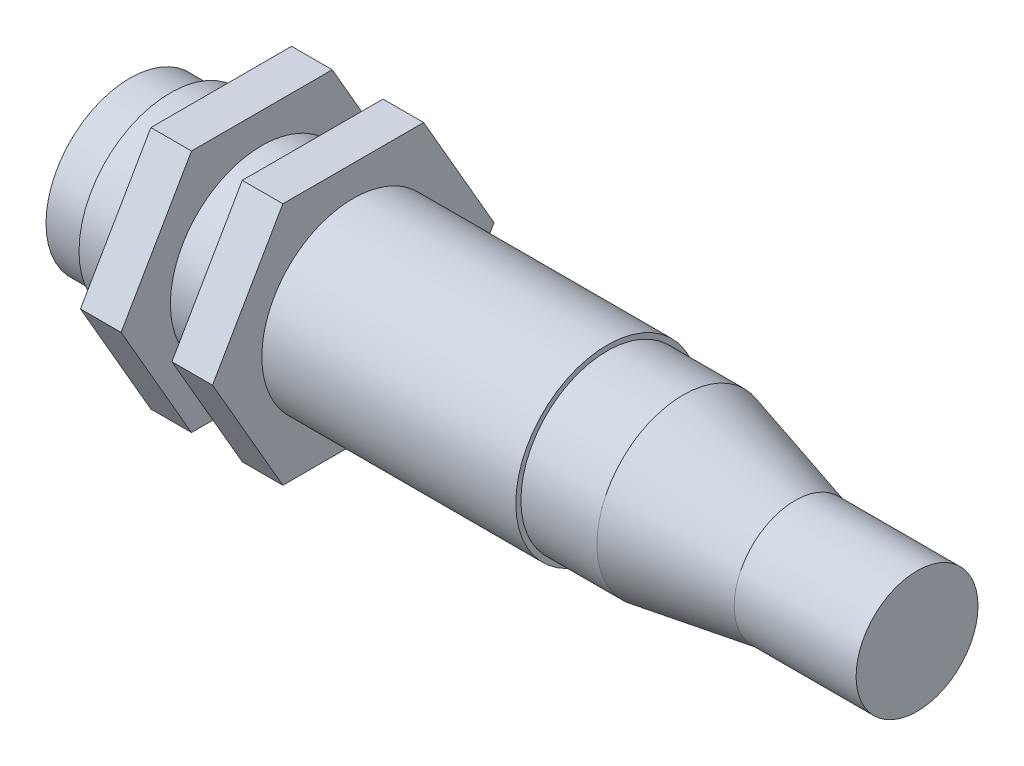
ISO-10303-21;
HEADER;
FILE_DESCRIPTION(('STEP AP214'),'2;1');
FILE_NAME('part.step','',(''),(''),'','','');
FILE_SCHEMA(('AUTOMOTIVE_DESIGN { 1 0 10303 214 1 1 1 1 }'));
ENDSEC;
DATA;
#1=APPLICATION_CONTEXT('core data for automotive mechanical design processes');
#2=APPLICATION_PROTOCOL_DEFINITION('international standard','automotive_design',2000,#1);
#3=PRODUCT_CONTEXT('',#1,'mechanical');
#4=PRODUCT('Part','Part','',(#3));
#5=PRODUCT_RELATED_PRODUCT_CATEGORY('part','',(#4));
#6=PRODUCT_DEFINITION_FORMATION('','',#4);
#7=PRODUCT_DEFINITION_CONTEXT('part definition',#1,'design');
#8=PRODUCT_DEFINITION('design','',#6,#7);
#9=PRODUCT_DEFINITION_SHAPE('','',#8);
#10=(LENGTH_UNIT() NAMED_UNIT(*) SI_UNIT(.MILLI.,.METRE.));
#11=(NAMED_UNIT(*) PLANE_ANGLE_UNIT() SI_UNIT($,.RADIAN.));
#12=(NAMED_UNIT(*) SI_UNIT($,.STERADIAN.) SOLID_ANGLE_UNIT());
#13=UNCERTAINTY_MEASURE_WITH_UNIT(LENGTH_MEASURE(1.E-05),#10,'distance_accuracy_value','');
#14=(GEOMETRIC_REPRESENTATION_CONTEXT(3) GLOBAL_UNCERTAINTY_ASSIGNED_CONTEXT((#13)) GLOBAL_UNIT_ASSIGNED_CONTEXT((#10,
#11,#12)) REPRESENTATION_CONTEXT('',''));
#15=CARTESIAN_POINT('',(0.,0.,0.));
#16=DIRECTION('',(0.,0.,1.));
#17=DIRECTION('',(1.,0.,0.));
#18=AXIS2_PLACEMENT_3D('',#15,#16,#17);
#19=CARTESIAN_POINT('',(9.,24.,0.));
#20=DIRECTION('',(1.,0.,0.));
#21=DIRECTION('',(0.,0.,-1.));
#22=AXIS2_PLACEMENT_3D('',#19,#20,#21);
#23=PLANE('',#22);
#24=DIRECTION('',(0.,0.866025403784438,0.5));
#25=VECTOR('',#24,1.);
#26=CARTESIAN_POINT('',(9.,0.,-13.856406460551));
#27=LINE('',#26,#25);
#28=CARTESIAN_POINT('',(9.,0.,-13.856406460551));
#29=VERTEX_POINT('',#28);
#30=CARTESIAN_POINT('',(9.,12.,-6.9282032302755));
#31=VERTEX_POINT('',#30);
#32=EDGE_CURVE('E133',#29,#31,#27,.T.);
#33=ORIENTED_EDGE('',*,*,#32,.T.);
#34=DIRECTION('',(0.,0.,1.));
#35=VECTOR('',#34,1.);
#36=CARTESIAN_POINT('',(9.,12.,-6.9282032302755));
#37=LINE('',#36,#35);
#38=CARTESIAN_POINT('',(9.,12.,6.92820323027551));
#39=VERTEX_POINT('',#38);
#40=EDGE_CURVE('E114',#31,#39,#37,.T.);
#41=ORIENTED_EDGE('',*,*,#40,.T.);
#42=DIRECTION('',(0.,-0.866025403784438,0.5));
#43=VECTOR('',#42,1.);
#44=CARTESIAN_POINT('',(9.,12.,6.92820323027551));
#45=LINE('',#44,#43);
#46=CARTESIAN_POINT('',(9.,0.,13.856406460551));
#47=VERTEX_POINT('',#46);
#48=EDGE_CURVE('E136',#39,#47,#45,.T.);
#49=ORIENTED_EDGE('',*,*,#48,.T.);
#50=DIRECTION('',(0.,-0.866025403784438,-0.5));
#51=VECTOR('',#50,1.);
#52=CARTESIAN_POINT('',(9.,0.,13.856406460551));
#53=LINE('',#52,#51);
#54=CARTESIAN_POINT('',(9.,-12.,6.9282032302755));
#55=VERTEX_POINT('',#54);
#56=EDGE_CURVE('E138',#47,#55,#53,.T.);
#57=ORIENTED_EDGE('',*,*,#56,.T.);
#58=DIRECTION('',(0.,0.,-1.));
#59=VECTOR('',#58,1.);
#60=CARTESIAN_POINT('',(9.,-12.,6.9282032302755));
#61=LINE('',#60,#59);
#62=CARTESIAN_POINT('',(9.,-12.,-6.92820323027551));
#63=VERTEX_POINT('',#62);
#64=EDGE_CURVE('E67',#55,#63,#61,.T.);
#65=ORIENTED_EDGE('',*,*,#64,.T.);
#66=DIRECTION('',(0.,0.866025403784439,-0.5));
#67=VECTOR('',#66,1.);
#68=CARTESIAN_POINT('',(9.,-12.,-6.92820323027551));
#69=LINE('',#68,#67);
#70=EDGE_CURVE('E62',#63,#29,#69,.T.);
#71=ORIENTED_EDGE('',*,*,#70,.T.);
#72=EDGE_LOOP('',(#33,#41,#49,#57,#65,#71));
#73=FACE_BOUND('',#72,.T.);
#74=CARTESIAN_POINT('',(9.,0.,0.));
#75=DIRECTION('',(1.,0.,0.));
#76=DIRECTION('',(0.,0.,-1.));
#77=AXIS2_PLACEMENT_3D('',#74,#75,#76);
#78=CIRCLE('',#77,9.);
#79=CARTESIAN_POINT('',(9.,0.,-9.));
#80=VERTEX_POINT('',#79);
#81=EDGE_CURVE('E119',#80,#80,#78,.T.);
#82=ORIENTED_EDGE('',*,*,#81,.F.);
#83=EDGE_LOOP('',(#82));
#84=FACE_BOUND('',#83,.T.);
#85=ADVANCED_FACE('F47',(#73,#84),#23,.T.);
#86=CARTESIAN_POINT('',(5.,24.,0.));
#87=DIRECTION('',(1.,0.,0.));
#88=DIRECTION('',(0.,0.,-1.));
#89=AXIS2_PLACEMENT_3D('',#86,#87,#88);
#90=PLANE('',#89);
#91=DIRECTION('',(0.,0.866025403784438,0.5));
#92=VECTOR('',#91,1.);
#93=CARTESIAN_POINT('',(5.,0.,-13.856406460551));
#94=LINE('',#93,#92);
#95=CARTESIAN_POINT('',(5.,0.,-13.856406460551));
#96=VERTEX_POINT('',#95);
#97=CARTESIAN_POINT('',(5.,12.,-6.9282032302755));
#98=VERTEX_POINT('',#97);
#99=EDGE_CURVE('E105',#96,#98,#94,.T.);
#100=ORIENTED_EDGE('',*,*,#99,.F.);
#101=DIRECTION('',(0.,0.866025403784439,-0.5));
#102=VECTOR('',#101,1.);
#103=CARTESIAN_POINT('',(5.,-12.,-6.92820323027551));
#104=LINE('',#103,#102);
#105=CARTESIAN_POINT('',(5.,-12.,-6.92820323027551));
#106=VERTEX_POINT('',#105);
#107=EDGE_CURVE('E131',#106,#96,#104,.T.);
#108=ORIENTED_EDGE('',*,*,#107,.F.);
#109=DIRECTION('',(0.,0.,-1.));
#110=VECTOR('',#109,1.);
#111=CARTESIAN_POINT('',(5.,-12.,6.9282032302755));
#112=LINE('',#111,#110);
#113=CARTESIAN_POINT('',(5.,-12.,6.9282032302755));
#114=VERTEX_POINT('',#113);
#115=EDGE_CURVE('E129',#114,#106,#112,.T.);
#116=ORIENTED_EDGE('',*,*,#115,.F.);
#117=DIRECTION('',(0.,-0.866025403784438,-0.5));
#118=VECTOR('',#117,1.);
#119=CARTESIAN_POINT('',(5.,0.,13.856406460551));
#120=LINE('',#119,#118);
#121=CARTESIAN_POINT('',(5.,0.,13.856406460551));
#122=VERTEX_POINT('',#121);
#123=EDGE_CURVE('E127',#122,#114,#120,.T.);
#124=ORIENTED_EDGE('',*,*,#123,.F.);
#125=DIRECTION('',(0.,-0.866025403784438,0.5));
#126=VECTOR('',#125,1.);
#127=CARTESIAN_POINT('',(5.,12.,6.92820323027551));
#128=LINE('',#127,#126);
#129=CARTESIAN_POINT('',(5.,12.,6.92820323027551));
#130=VERTEX_POINT('',#129);
#131=EDGE_CURVE('E107',#130,#122,#128,.T.);
#132=ORIENTED_EDGE('',*,*,#131,.F.);
#133=DIRECTION('',(0.,0.,1.));
#134=VECTOR('',#133,1.);
#135=CARTESIAN_POINT('',(5.,12.,-6.9282032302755));
#136=LINE('',#135,#134);
#137=EDGE_CURVE('E100',#98,#130,#136,.T.);
#138=ORIENTED_EDGE('',*,*,#137,.F.);
#139=EDGE_LOOP('',(#100,#108,#116,#124,#132,#138));
#140=FACE_BOUND('',#139,.T.);
#141=CARTESIAN_POINT('',(5.,0.,0.));
#142=DIRECTION('',(1.,0.,0.));
#143=DIRECTION('',(0.,0.,-1.));
#144=AXIS2_PLACEMENT_3D('',#141,#142,#143);
#145=CIRCLE('',#144,9.);
#146=CARTESIAN_POINT('',(5.,0.,-9.));
#147=VERTEX_POINT('',#146);
#148=EDGE_CURVE('E122',#147,#147,#145,.T.);
#149=ORIENTED_EDGE('',*,*,#148,.T.);
#150=EDGE_LOOP('',(#149));
#151=FACE_BOUND('',#150,.T.);
#152=ADVANCED_FACE('F101',(#140,#151),#90,.F.);
#153=CARTESIAN_POINT('',(9.,0.,-13.856406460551));
#154=DIRECTION('',(0.,-0.5,0.866025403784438));
#155=DIRECTION('',(0.,-0.866025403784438,-0.5));
#156=AXIS2_PLACEMENT_3D('',#153,#154,#155);
#157=PLANE('',#156);
#158=ORIENTED_EDGE('',*,*,#99,.T.);
#159=DIRECTION('',(-1.,0.,0.));
#160=VECTOR('',#159,1.);
#161=CARTESIAN_POINT('',(9.,12.,-6.9282032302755));
#162=LINE('',#161,#160);
#163=EDGE_CURVE('E12',#31,#98,#162,.T.);
#164=ORIENTED_EDGE('',*,*,#163,.F.);
#165=ORIENTED_EDGE('',*,*,#32,.F.);
#166=DIRECTION('',(-1.,0.,0.));
#167=VECTOR('',#166,1.);
#168=CARTESIAN_POINT('',(9.,0.,-13.856406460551));
#169=LINE('',#168,#167);
#170=EDGE_CURVE('E118',#29,#96,#169,.T.);
#171=ORIENTED_EDGE('',*,*,#170,.T.);
#172=EDGE_LOOP('',(#158,#164,#165,#171));
#173=FACE_BOUND('',#172,.T.);
#174=ADVANCED_FACE('F49',(#173),#157,.F.);
#175=CARTESIAN_POINT('',(9.,12.,-6.9282032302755));
#176=DIRECTION('',(0.,-1.,0.));
#177=DIRECTION('',(0.,0.,-1.));
#178=AXIS2_PLACEMENT_3D('',#175,#176,#177);
#179=PLANE('',#178);
#180=ORIENTED_EDGE('',*,*,#137,.T.);
#181=DIRECTION('',(-1.,0.,0.));
#182=VECTOR('',#181,1.);
#183=CARTESIAN_POINT('',(9.,12.,6.92820323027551));
#184=LINE('',#183,#182);
#185=EDGE_CURVE('E55',#39,#130,#184,.T.);
#186=ORIENTED_EDGE('',*,*,#185,.F.);
#187=ORIENTED_EDGE('',*,*,#40,.F.);
#188=ORIENTED_EDGE('',*,*,#163,.T.);
#189=EDGE_LOOP('',(#180,#186,#187,#188));
#190=FACE_BOUND('',#189,.T.);
#191=ADVANCED_FACE('F113',(#190),#179,.F.);
#192=CARTESIAN_POINT('',(9.,12.,6.92820323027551));
#193=DIRECTION('',(0.,-0.5,-0.866025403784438));
#194=DIRECTION('',(0.,0.866025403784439,-0.5));
#195=AXIS2_PLACEMENT_3D('',#192,#193,#194);
#196=PLANE('',#195);
#197=ORIENTED_EDGE('',*,*,#131,.T.);
#198=DIRECTION('',(-1.,0.,0.));
#199=VECTOR('',#198,1.);
#200=CARTESIAN_POINT('',(9.,0.,13.856406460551));
#201=LINE('',#200,#199);
#202=EDGE_CURVE('E149',#47,#122,#201,.T.);
#203=ORIENTED_EDGE('',*,*,#202,.F.);
#204=ORIENTED_EDGE('',*,*,#48,.F.);
#205=ORIENTED_EDGE('',*,*,#185,.T.);
#206=EDGE_LOOP('',(#197,#203,#204,#205));
#207=FACE_BOUND('',#206,.T.);
#208=ADVANCED_FACE('F153',(#207),#196,.F.);
#209=CARTESIAN_POINT('',(9.,0.,13.856406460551));
#210=DIRECTION('',(0.,0.5,-0.866025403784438));
#211=DIRECTION('',(0.,0.866025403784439,0.5));
#212=AXIS2_PLACEMENT_3D('',#209,#210,#211);
#213=PLANE('',#212);
#214=ORIENTED_EDGE('',*,*,#123,.T.);
#215=DIRECTION('',(-1.,0.,0.));
#216=VECTOR('',#215,1.);
#217=CARTESIAN_POINT('',(9.,-12.,6.9282032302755));
#218=LINE('',#217,#216);
#219=EDGE_CURVE('E146',#55,#114,#218,.T.);
#220=ORIENTED_EDGE('',*,*,#219,.F.);
#221=ORIENTED_EDGE('',*,*,#56,.F.);
#222=ORIENTED_EDGE('',*,*,#202,.T.);
#223=EDGE_LOOP('',(#214,#220,#221,#222));
#224=FACE_BOUND('',#223,.T.);
#225=ADVANCED_FACE('F159',(#224),#213,.F.);
#226=CARTESIAN_POINT('',(9.,-12.,6.9282032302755));
#227=DIRECTION('',(0.,1.,0.));
#228=DIRECTION('',(0.,0.,1.));
#229=AXIS2_PLACEMENT_3D('',#226,#227,#228);
#230=PLANE('',#229);
#231=ORIENTED_EDGE('',*,*,#115,.T.);
#232=DIRECTION('',(-1.,0.,0.));
#233=VECTOR('',#232,1.);
#234=CARTESIAN_POINT('',(9.,-12.,-6.92820323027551));
#235=LINE('',#234,#233);
#236=EDGE_CURVE('E143',#63,#106,#235,.T.);
#237=ORIENTED_EDGE('',*,*,#236,.F.);
#238=ORIENTED_EDGE('',*,*,#64,.F.);
#239=ORIENTED_EDGE('',*,*,#219,.T.);
#240=EDGE_LOOP('',(#231,#237,#238,#239));
#241=FACE_BOUND('',#240,.T.);
#242=ADVANCED_FACE('F162',(#241),#230,.F.);
#243=CARTESIAN_POINT('',(9.,-12.,-6.92820323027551));
#244=DIRECTION('',(0.,0.5,0.866025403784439));
#245=DIRECTION('',(0.,-0.866025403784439,0.5));
#246=AXIS2_PLACEMENT_3D('',#243,#244,#245);
#247=PLANE('',#246);
#248=ORIENTED_EDGE('',*,*,#107,.T.);
#249=ORIENTED_EDGE('',*,*,#170,.F.);
#250=ORIENTED_EDGE('',*,*,#70,.F.);
#251=ORIENTED_EDGE('',*,*,#236,.T.);
#252=EDGE_LOOP('',(#248,#249,#250,#251));
#253=FACE_BOUND('',#252,.T.);
#254=ADVANCED_FACE('F164',(#253),#247,.F.);
#255=CARTESIAN_POINT('',(9.,0.,0.));
#256=DIRECTION('',(-1.,0.,0.));
#257=DIRECTION('',(0.,0.,1.));
#258=AXIS2_PLACEMENT_3D('',#255,#256,#257);
#259=CYLINDRICAL_SURFACE('',#258,9.);
#260=ORIENTED_EDGE('',*,*,#81,.T.);
#261=EDGE_LOOP('',(#260));
#262=FACE_BOUND('',#261,.T.);
#263=ORIENTED_EDGE('',*,*,#148,.F.);
#264=EDGE_LOOP('',(#263));
#265=FACE_BOUND('',#264,.T.);
#266=ADVANCED_FACE('F166',(#262,#265),#259,.F.);
#267=CLOSED_SHELL('',(#85,#152,#174,#191,#208,#225,#242,#254,#266));
#268=MANIFOLD_SOLID_BREP('B2',#267);
#269=CARTESIAN_POINT('',(43.,0.,0.));
#270=DIRECTION('',(-1.,0.,0.));
#271=DIRECTION('',(0.,0.,1.));
#272=AXIS2_PLACEMENT_3D('',#269,#270,#271);
#273=PLANE('',#272);
#274=CARTESIAN_POINT('',(43.,0.,0.));
#275=DIRECTION('',(-1.,0.,0.));
#276=DIRECTION('',(0.,0.,1.));
#277=AXIS2_PLACEMENT_3D('',#274,#275,#276);
#278=CIRCLE('',#277,9.);
#279=CARTESIAN_POINT('',(43.,0.,9.));
#280=VERTEX_POINT('',#279);
#281=EDGE_CURVE('E273',#280,#280,#278,.T.);
#282=ORIENTED_EDGE('',*,*,#281,.F.);
#283=EDGE_LOOP('',(#282));
#284=FACE_BOUND('',#283,.T.);
#285=CARTESIAN_POINT('',(43.,0.,0.));
#286=DIRECTION('',(-1.,0.,0.));
#287=DIRECTION('',(0.,0.,1.));
#288=AXIS2_PLACEMENT_3D('',#285,#286,#287);
#289=CIRCLE('',#288,8.5);
#290=CARTESIAN_POINT('',(43.,0.,8.5));
#291=VERTEX_POINT('',#290);
#292=EDGE_CURVE('E46',#291,#291,#289,.F.);
#293=ORIENTED_EDGE('',*,*,#292,.F.);
#294=EDGE_LOOP('',(#293));
#295=FACE_BOUND('',#294,.T.);
#296=ADVANCED_FACE('F252',(#284,#295),#273,.F.);
#297=CARTESIAN_POINT('',(0.,0.,0.));
#298=DIRECTION('',(1.,0.,0.));
#299=DIRECTION('',(0.,0.,-1.));
#300=AXIS2_PLACEMENT_3D('',#297,#298,#299);
#301=PLANE('',#300);
#302=CARTESIAN_POINT('',(0.,0.,0.));
#303=DIRECTION('',(-1.,0.,0.));
#304=DIRECTION('',(0.,0.,1.));
#305=AXIS2_PLACEMENT_3D('',#302,#303,#304);
#306=CIRCLE('',#305,9.);
#307=CARTESIAN_POINT('',(0.,0.,9.));
#308=VERTEX_POINT('',#307);
#309=EDGE_CURVE('E268',#308,#308,#306,.T.);
#310=ORIENTED_EDGE('',*,*,#309,.T.);
#311=EDGE_LOOP('',(#310));
#312=FACE_BOUND('',#311,.T.);
#313=CARTESIAN_POINT('',(0.,0.,0.));
#314=DIRECTION('',(1.,0.,0.));
#315=DIRECTION('',(0.,0.,-1.));
#316=AXIS2_PLACEMENT_3D('',#313,#314,#315);
#317=CIRCLE('',#316,8.25);
#318=CARTESIAN_POINT('',(0.,0.,-8.25));
#319=VERTEX_POINT('',#318);
#320=EDGE_CURVE('E264',#319,#319,#317,.F.);
#321=ORIENTED_EDGE('',*,*,#320,.F.);
#322=EDGE_LOOP('',(#321));
#323=FACE_BOUND('',#322,.T.);
#324=ADVANCED_FACE('F254',(#312,#323),#301,.F.);
#325=CARTESIAN_POINT('',(0.,0.,0.));
#326=DIRECTION('',(-1.,0.,0.));
#327=DIRECTION('',(0.,0.,1.));
#328=AXIS2_PLACEMENT_3D('',#325,#326,#327);
#329=CYLINDRICAL_SURFACE('',#328,9.);
#330=ORIENTED_EDGE('',*,*,#309,.F.);
#331=EDGE_LOOP('',(#330));
#332=FACE_BOUND('',#331,.T.);
#333=ORIENTED_EDGE('',*,*,#281,.T.);
#334=EDGE_LOOP('',(#333));
#335=FACE_BOUND('',#334,.T.);
#336=ADVANCED_FACE('F323',(#332,#335),#329,.T.);
#337=CARTESIAN_POINT('',(-4.,0.,0.));
#338=DIRECTION('',(1.,0.,0.));
#339=DIRECTION('',(0.,0.,-1.));
#340=AXIS2_PLACEMENT_3D('',#337,#338,#339);
#341=CYLINDRICAL_SURFACE('',#340,8.25);
#342=CARTESIAN_POINT('',(-4.,0.,0.));
#343=DIRECTION('',(-1.,0.,0.));
#344=DIRECTION('',(0.,0.,1.));
#345=AXIS2_PLACEMENT_3D('',#342,#343,#344);
#346=CIRCLE('',#345,8.25);
#347=CARTESIAN_POINT('',(-4.,0.,8.25));
#348=VERTEX_POINT('',#347);
#349=EDGE_CURVE('E276',#348,#348,#346,.T.);
#350=ORIENTED_EDGE('',*,*,#349,.F.);
#351=EDGE_LOOP('',(#350));
#352=FACE_BOUND('',#351,.T.);
#353=ORIENTED_EDGE('',*,*,#320,.T.);
#354=EDGE_LOOP('',(#353));
#355=FACE_BOUND('',#354,.T.);
#356=ADVANCED_FACE('F319',(#352,#355),#341,.T.);
#357=CARTESIAN_POINT('',(-4.,0.,0.));
#358=DIRECTION('',(-1.,0.,0.));
#359=DIRECTION('',(0.,0.,1.));
#360=AXIS2_PLACEMENT_3D('',#357,#358,#359);
#361=PLANE('',#360);
#362=ORIENTED_EDGE('',*,*,#349,.T.);
#363=EDGE_LOOP('',(#362));
#364=FACE_BOUND('',#363,.T.);
#365=ADVANCED_FACE('F315',(#364),#361,.T.);
#366=CARTESIAN_POINT('',(50.5,0.,0.));
#367=DIRECTION('',(-1.,0.,0.));
#368=DIRECTION('',(0.,0.,1.));
#369=AXIS2_PLACEMENT_3D('',#366,#367,#368);
#370=CYLINDRICAL_SURFACE('',#369,8.5);
#371=CARTESIAN_POINT('',(50.4886719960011,-8.45758827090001,0.848056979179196));
#372=CARTESIAN_POINT('',(50.4878609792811,-8.44171022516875,1.00640847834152));
#373=CARTESIAN_POINT('',(50.4869423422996,-8.42138395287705,1.16431095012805));
#374=CARTESIAN_POINT('',(50.4854039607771,-8.37189222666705,1.47876966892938));
#375=CARTESIAN_POINT('',(50.4847842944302,-8.34272446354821,1.63532555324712));
#376=CARTESIAN_POINT('',(50.4841293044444,-8.27564108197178,1.94656313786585));
#377=CARTESIAN_POINT('',(50.4840940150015,-8.23772495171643,2.10124472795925));
#378=CARTESIAN_POINT('',(50.484662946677,-8.15322068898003,2.40840060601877));
#379=CARTESIAN_POINT('',(50.4852678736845,-8.1066230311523,2.56087226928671));
#380=CARTESIAN_POINT('',(50.486948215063,-8.00492950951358,2.86295246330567));
#381=CARTESIAN_POINT('',(50.488023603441,-7.94983411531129,3.01256115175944));
#382=CARTESIAN_POINT('',(50.4897005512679,-7.86095814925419,3.23445334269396));
#383=CARTESIAN_POINT('',(50.490270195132,-7.83029305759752,3.30799931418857));
#384=CARTESIAN_POINT('',(50.491365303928,-7.76690542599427,3.45420442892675));
#385=CARTESIAN_POINT('',(50.4918907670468,-7.73418280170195,3.52686353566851));
#386=CARTESIAN_POINT('',(50.4930509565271,-7.64986346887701,3.70727094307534));
#387=CARTESIAN_POINT('',(50.4936092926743,-7.59699894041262,3.81443009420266));
#388=CARTESIAN_POINT('',(50.4942065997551,-7.48679741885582,4.02643002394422));
#389=CARTESIAN_POINT('',(50.4942455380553,-7.429460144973,4.13127065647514));
#390=CARTESIAN_POINT('',(50.4940928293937,-7.31041594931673,4.3384431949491));
#391=CARTESIAN_POINT('',(50.4939011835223,-7.24870904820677,4.4407751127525));
#392=CARTESIAN_POINT('',(50.4934672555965,-7.12104305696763,4.64273876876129));
#393=CARTESIAN_POINT('',(50.493224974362,-7.05508403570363,4.74237055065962));
#394=CARTESIAN_POINT('',(50.4926292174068,-6.85102882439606,5.03690566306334));
#395=CARTESIAN_POINT('',(50.4924064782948,-6.7066984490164,5.22754625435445));
#396=CARTESIAN_POINT('',(50.4925233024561,-6.40251723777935,5.59596815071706));
#397=CARTESIAN_POINT('',(50.4928628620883,-6.24266650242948,5.77374953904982));
#398=CARTESIAN_POINT('',(50.4933178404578,-5.90853944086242,6.11524512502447));
#399=CARTESIAN_POINT('',(50.4934332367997,-5.73426167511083,6.27895791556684));
#400=CARTESIAN_POINT('',(50.4920137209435,-5.37254109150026,6.59112103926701));
#401=CARTESIAN_POINT('',(50.4904788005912,-5.18509820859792,6.73957129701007));
#402=CARTESIAN_POINT('',(50.4876735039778,-4.79837310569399,7.02016345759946));
#403=CARTESIAN_POINT('',(50.4864031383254,-4.59909041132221,7.15230470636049));
#404=CARTESIAN_POINT('',(50.4849673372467,-4.19008195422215,7.39934293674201));
#405=CARTESIAN_POINT('',(50.4848018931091,-3.98035627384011,7.51424005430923));
#406=CARTESIAN_POINT('',(50.4853798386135,-3.62341318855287,7.69066079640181));
#407=CARTESIAN_POINT('',(50.4858387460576,-3.47865483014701,7.75721155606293));
#408=CARTESIAN_POINT('',(50.4869868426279,-3.18562156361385,7.88207935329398));
#409=CARTESIAN_POINT('',(50.4876760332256,-3.03734663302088,7.94039633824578));
#410=CARTESIAN_POINT('',(50.4889468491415,-2.73774867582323,8.04860845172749));
#411=CARTESIAN_POINT('',(50.4895284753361,-2.58642567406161,8.09850364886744));
#412=CARTESIAN_POINT('',(50.489994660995,-2.35753402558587,8.16690744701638));
#413=CARTESIAN_POINT('',(50.4900823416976,-2.28091520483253,8.18863644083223));
#414=CARTESIAN_POINT('',(50.4900474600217,-2.12709733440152,8.22993309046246));
#415=CARTESIAN_POINT('',(50.4899248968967,-2.0498982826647,8.24950073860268));
#416=CARTESIAN_POINT('',(50.4893350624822,-1.81752295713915,8.3049363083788));
#417=CARTESIAN_POINT('',(50.4886456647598,-1.66155423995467,8.33754112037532));
#418=CARTESIAN_POINT('',(50.487190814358,-1.3480508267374,8.39393452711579));
#419=CARTESIAN_POINT('',(50.4864253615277,-1.19051612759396,8.41772310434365));
#420=CARTESIAN_POINT('',(50.4848399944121,-0.795276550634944,8.46608414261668));
#421=CARTESIAN_POINT('',(50.4841841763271,-0.556866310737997,8.48510257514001));
#422=CARTESIAN_POINT('',(50.4839313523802,-0.0793229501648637,8.50298923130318));
#423=CARTESIAN_POINT('',(50.4843343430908,0.159810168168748,8.50185752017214));
#424=CARTESIAN_POINT('',(50.4859308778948,0.637166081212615,8.47945069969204));
#425=CARTESIAN_POINT('',(50.487124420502,0.875388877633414,8.45817562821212));
#426=CARTESIAN_POINT('',(50.4888498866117,1.23067846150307,8.41128527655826));
#427=CARTESIAN_POINT('',(50.4894142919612,1.34878030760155,8.39315607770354));
#428=CARTESIAN_POINT('',(50.4903733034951,1.58412354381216,8.351934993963));
#429=CARTESIAN_POINT('',(50.4907679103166,1.70136493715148,8.32884312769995));
#430=CARTESIAN_POINT('',(50.4911735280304,1.93475094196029,8.27774175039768));
#431=CARTESIAN_POINT('',(50.4911845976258,2.0508957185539,8.24973299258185));
#432=CARTESIAN_POINT('',(50.4908201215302,2.28190142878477,8.18884568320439));
#433=CARTESIAN_POINT('',(50.4904445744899,2.39676235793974,8.15596711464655));
#434=CARTESIAN_POINT('',(50.4895485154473,2.62499862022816,8.08539725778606));
#435=CARTESIAN_POINT('',(50.4890280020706,2.7383739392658,8.04770592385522));
#436=CARTESIAN_POINT('',(50.4879796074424,2.96342789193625,7.96758226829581));
#437=CARTESIAN_POINT('',(50.4874517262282,3.07510653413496,7.92514997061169));
#438=CARTESIAN_POINT('',(50.4860384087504,3.40730171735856,7.79084874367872));
#439=CARTESIAN_POINT('',(50.4853229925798,3.62502771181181,7.69195995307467));
#440=CARTESIAN_POINT('',(50.4847549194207,4.05136555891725,7.47619703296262));
#441=CARTESIAN_POINT('',(50.4849022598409,4.25997743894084,7.35932295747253));
#442=CARTESIAN_POINT('',(50.4856814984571,4.59882571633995,7.15025765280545));
#443=CARTESIAN_POINT('',(50.4861355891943,4.73201681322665,7.06281724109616));
#444=CARTESIAN_POINT('',(50.4871284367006,4.99328155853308,6.88058878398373));
#445=CARTESIAN_POINT('',(50.4876671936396,5.12135519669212,6.7858007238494));
#446=CARTESIAN_POINT('',(50.4885533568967,5.37197862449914,6.58917386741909));
#447=CARTESIAN_POINT('',(50.4889007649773,5.49452846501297,6.48733513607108));
#448=CARTESIAN_POINT('',(50.4889958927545,5.6739045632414,6.32954590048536));
#449=CARTESIAN_POINT('',(50.4889565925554,5.73295786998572,6.27610828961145));
#450=CARTESIAN_POINT('',(50.4887033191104,5.84953952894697,6.1675950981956));
#451=CARTESIAN_POINT('',(50.488489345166,5.90706787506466,6.11251951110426));
#452=CARTESIAN_POINT('',(50.4876900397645,6.07729547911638,5.94490012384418));
#453=CARTESIAN_POINT('',(50.4869473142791,6.18764837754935,5.8299539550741));
#454=CARTESIAN_POINT('',(50.4854193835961,6.40170994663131,5.59405834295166));
#455=CARTESIAN_POINT('',(50.4846341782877,6.50541859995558,5.47310888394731));
#456=CARTESIAN_POINT('',(50.4829780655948,6.75601142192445,5.16365722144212));
#457=CARTESIAN_POINT('',(50.4822605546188,6.89856084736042,4.97161189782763));
#458=CARTESIAN_POINT('',(50.4818784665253,7.16695878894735,4.57622332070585));
#459=CARTESIAN_POINT('',(50.4822138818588,7.29280742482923,4.37288014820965));
#460=CARTESIAN_POINT('',(50.483901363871,7.52694381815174,3.95628386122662));
#461=CARTESIAN_POINT('',(50.4852534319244,7.63523155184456,3.74303073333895));
#462=CARTESIAN_POINT('',(50.4876411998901,7.78387973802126,3.4169439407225));
#463=CARTESIAN_POINT('',(50.4884971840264,7.83113646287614,3.30720106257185));
#464=CARTESIAN_POINT('',(50.4902137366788,7.92098600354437,3.08581370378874));
#465=CARTESIAN_POINT('',(50.4910743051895,7.96357882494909,2.97416922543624));
#466=CARTESIAN_POINT('',(50.4926735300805,8.04400303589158,2.74923212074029));
#467=CARTESIAN_POINT('',(50.4934122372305,8.08183640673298,2.63594020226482));
#468=CARTESIAN_POINT('',(50.4945885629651,8.15269668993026,2.40786145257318));
#469=CARTESIAN_POINT('',(50.4950261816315,8.18572360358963,2.29307462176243));
#470=CARTESIAN_POINT('',(50.495696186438,8.24691173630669,2.06220904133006));
#471=CARTESIAN_POINT('',(50.4959285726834,8.27507295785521,1.94613029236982));
#472=CARTESIAN_POINT('',(50.4963002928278,8.32647885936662,1.71289652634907));
#473=CARTESIAN_POINT('',(50.4964396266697,8.34972353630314,1.59574150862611));
#474=CARTESIAN_POINT('',(50.4968378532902,8.41201601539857,1.24297541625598));
#475=CARTESIAN_POINT('',(50.4970770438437,8.44363628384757,1.00601038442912));
#476=CARTESIAN_POINT('',(50.497787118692,8.48680599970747,0.53025915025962));
#477=CARTESIAN_POINT('',(50.4982580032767,8.49835542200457,0.291472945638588));
#478=CARTESIAN_POINT('',(50.4989803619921,8.50057789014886,-0.0667926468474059));
#479=CARTESIAN_POINT('',(50.49922390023,8.49879879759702,-0.186266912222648));
#480=CARTESIAN_POINT('',(50.4996452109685,8.49020652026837,-0.425041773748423));
#481=CARTESIAN_POINT('',(50.4998229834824,8.48339333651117,-0.544342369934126));
#482=CARTESIAN_POINT('',(50.5000171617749,8.46474404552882,-0.782548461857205));
#483=CARTESIAN_POINT('',(50.5000335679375,8.45290795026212,-0.901453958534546));
#484=CARTESIAN_POINT('',(50.49970190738,8.42423445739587,-1.13865980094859));
#485=CARTESIAN_POINT('',(50.4993538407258,8.40739706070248,-1.25696014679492));
#486=CARTESIAN_POINT('',(50.4984816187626,8.36874993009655,-1.49274750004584));
#487=CARTESIAN_POINT('',(50.4979574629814,8.34694018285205,-1.6102345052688));
#488=CARTESIAN_POINT('',(50.4968397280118,8.2983908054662,-1.84417662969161));
#489=CARTESIAN_POINT('',(50.4962461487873,8.27165117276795,-1.96063174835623));
#490=CARTESIAN_POINT('',(50.4945213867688,8.18410101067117,-2.30814444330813));
#491=CARTESIAN_POINT('',(50.493445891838,8.11595061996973,-2.53740177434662));
#492=CARTESIAN_POINT('',(50.4919419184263,7.96059526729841,-2.98932169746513));
#493=CARTESIAN_POINT('',(50.4915134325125,7.87339052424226,-3.21198436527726));
#494=CARTESIAN_POINT('',(50.4913670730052,7.68051598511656,-3.64921030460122));
#495=CARTESIAN_POINT('',(50.4916492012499,7.57484614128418,-3.86377355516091));
#496=CARTESIAN_POINT('',(50.4922986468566,7.40310616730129,-4.17831415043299));
#497=CARTESIAN_POINT('',(50.4925528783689,7.34364630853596,-4.28195473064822));
#498=CARTESIAN_POINT('',(50.4930425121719,7.22040728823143,-4.48664509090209));
#499=CARTESIAN_POINT('',(50.4932779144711,7.15662812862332,-4.587694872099));
#500=CARTESIAN_POINT('',(50.4935926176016,7.02486780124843,-4.78701436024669));
#501=CARTESIAN_POINT('',(50.4936719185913,6.95688663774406,-4.88528407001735));
#502=CARTESIAN_POINT('',(50.4935979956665,6.81684264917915,-5.0788707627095));
#503=CARTESIAN_POINT('',(50.4934447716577,6.74477982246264,-5.17418774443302));
#504=CARTESIAN_POINT('',(50.4930670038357,6.59669650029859,-5.36170374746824));
#505=CARTESIAN_POINT('',(50.4928424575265,6.52067586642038,-5.45390265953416));
#506=CARTESIAN_POINT('',(50.4924173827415,6.36482124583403,-5.63500910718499));
#507=CARTESIAN_POINT('',(50.4922168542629,6.28498725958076,-5.7239166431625));
#508=CARTESIAN_POINT('',(50.4917794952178,6.03997516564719,-5.98546166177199));
#509=CARTESIAN_POINT('',(50.4917067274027,5.86925358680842,-6.15296375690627));
#510=CARTESIAN_POINT('',(50.4922720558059,5.51430415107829,-6.47298623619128));
#511=CARTESIAN_POINT('',(50.4929101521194,5.33007629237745,-6.62550661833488));
#512=CARTESIAN_POINT('',(50.4941743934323,5.04464055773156,-6.84221366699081));
#513=CARTESIAN_POINT('',(50.4946470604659,4.94796826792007,-6.91244431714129));
#514=CARTESIAN_POINT('',(50.4956061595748,4.75174399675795,-7.04877274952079));
#515=CARTESIAN_POINT('',(50.4960925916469,4.65219201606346,-7.11487053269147));
#516=CARTESIAN_POINT('',(50.4969302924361,4.45038850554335,-7.24281130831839));
#517=CARTESIAN_POINT('',(50.4972815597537,4.34813694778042,-7.3046542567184));
#518=CARTESIAN_POINT('',(50.4978178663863,4.14112400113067,-7.42397258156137));
#519=CARTESIAN_POINT('',(50.4980029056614,4.03636261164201,-7.48144795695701));
#520=CARTESIAN_POINT('',(50.4984782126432,3.71859221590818,-7.64716452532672));
#521=CARTESIAN_POINT('',(50.4986887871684,3.50205199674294,-7.74872467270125));
#522=CARTESIAN_POINT('',(50.4991678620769,3.06118438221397,-7.93323720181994));
#523=CARTESIAN_POINT('',(50.4994363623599,2.83685700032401,-8.01618961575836));
#524=CARTESIAN_POINT('',(50.4996691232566,2.49577919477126,-8.12621514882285));
#525=CARTESIAN_POINT('',(50.4997183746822,2.38130924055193,-8.16049280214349));
#526=CARTESIAN_POINT('',(50.4996310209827,2.15101989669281,-8.22419494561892));
#527=CARTESIAN_POINT('',(50.4994944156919,2.03520050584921,-8.25361943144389));
#528=CARTESIAN_POINT('',(50.4990969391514,1.80242439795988,-8.30755912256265));
#529=CARTESIAN_POINT('',(50.4988360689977,1.68546769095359,-8.33207437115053));
#530=CARTESIAN_POINT('',(50.4983068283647,1.45063630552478,-8.37615269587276));
#531=CARTESIAN_POINT('',(50.4980384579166,1.33276163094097,-8.39571579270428));
#532=CARTESIAN_POINT('',(50.4973368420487,0.978045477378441,-8.44692031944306));
#533=CARTESIAN_POINT('',(50.4970069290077,0.740060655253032,-8.47108884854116));
#534=CARTESIAN_POINT('',(50.4968222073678,0.382286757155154,-8.49224089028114));
#535=CARTESIAN_POINT('',(50.4968123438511,0.26288031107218,-8.49677438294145));
#536=CARTESIAN_POINT('',(50.4968400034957,0.0239795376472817,-8.50080519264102));
#537=CARTESIAN_POINT('',(50.4968775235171,-0.0955147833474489,-8.50030284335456));
#538=CARTESIAN_POINT('',(50.4969190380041,-0.334363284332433,-8.49426113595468));
#539=CARTESIAN_POINT('',(50.4969230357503,-0.453717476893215,-8.48872227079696));
#540=CARTESIAN_POINT('',(50.4967377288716,-0.692110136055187,-8.47261845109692));
#541=CARTESIAN_POINT('',(50.4965483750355,-0.811148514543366,-8.4620522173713));
#542=CARTESIAN_POINT('',(50.4955432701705,-1.16741470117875,-8.42283834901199));
#543=CARTESIAN_POINT('',(50.4942906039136,-1.40385552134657,-8.38667397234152));
#544=CARTESIAN_POINT('',(50.4917812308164,-1.87284883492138,-8.29454926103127));
#545=CARTESIAN_POINT('',(50.4905245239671,-2.10540131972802,-8.23858888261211));
#546=CARTESIAN_POINT('',(50.4889408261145,-2.45003867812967,-8.14012304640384));
#547=CARTESIAN_POINT('',(50.4884630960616,-2.56423906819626,-8.1048727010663));
#548=CARTESIAN_POINT('',(50.4875877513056,-2.79103049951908,-8.02959623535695));
#549=CARTESIAN_POINT('',(50.4871901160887,-2.90362194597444,-7.98957134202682));
#550=CARTESIAN_POINT('',(50.4864134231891,-3.1270249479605,-7.9048081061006));
#551=CARTESIAN_POINT('',(50.4860343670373,-3.2378363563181,-7.86006937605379));
#552=CARTESIAN_POINT('',(50.4851702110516,-3.4574823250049,-7.76595723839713));
#553=CARTESIAN_POINT('',(50.4846851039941,-3.56631675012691,-7.71658351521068));
#554=CARTESIAN_POINT('',(50.4834467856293,-3.78181572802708,-7.61328762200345));
#555=CARTESIAN_POINT('',(50.4826935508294,-3.88848008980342,-7.55936505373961));
#556=CARTESIAN_POINT('',(50.4806191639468,-4.09943379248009,-7.44707462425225));
#557=CARTESIAN_POINT('',(50.4792980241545,-4.2037231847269,-7.38870685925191));
#558=CARTESIAN_POINT('',(50.4760839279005,-4.40974639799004,-7.26762766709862));
#559=CARTESIAN_POINT('',(50.4741909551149,-4.51148014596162,-7.20491611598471));
#560=CARTESIAN_POINT('',(50.4701684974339,-4.71220475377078,-7.07526724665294));
#561=CARTESIAN_POINT('',(50.4680390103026,-4.81119558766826,-7.00832988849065));
#562=CARTESIAN_POINT('',(50.4616707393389,-5.10377316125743,-6.80136327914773));
#563=CARTESIAN_POINT('',(50.4574507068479,-5.2930341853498,-6.65513880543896));
#564=CARTESIAN_POINT('',(50.4507457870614,-5.65855428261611,-6.34727289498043));
#565=CARTESIAN_POINT('',(50.4482608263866,-5.8348139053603,-6.18563211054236));
#566=CARTESIAN_POINT('',(50.445905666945,-6.17293256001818,-5.84823779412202));
#567=CARTESIAN_POINT('',(50.4460328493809,-6.33480585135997,-5.67249857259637));
#568=CARTESIAN_POINT('',(50.4488103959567,-6.64320098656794,-5.30799952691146));
#569=CARTESIAN_POINT('',(50.4514608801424,-6.78972209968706,-5.11923908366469));
#570=CARTESIAN_POINT('',(50.4563999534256,-6.99718142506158,-4.82739292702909));
#571=CARTESIAN_POINT('',(50.4582074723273,-7.06429686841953,-4.72863278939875));
#572=CARTESIAN_POINT('',(50.461862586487,-7.19431415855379,-4.52836518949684));
#573=CARTESIAN_POINT('',(50.4637101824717,-7.25721592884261,-4.42685767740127));
#574=CARTESIAN_POINT('',(50.4671394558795,-7.37868617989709,-4.22128486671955));
#575=CARTESIAN_POINT('',(50.4687211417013,-7.43725479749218,-4.11721964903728));
#576=CARTESIAN_POINT('',(50.4711384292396,-7.54995731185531,-3.9067116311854));
#577=CARTESIAN_POINT('',(50.4719740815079,-7.60409150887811,-3.80026899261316));
#578=CARTESIAN_POINT('',(50.4728241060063,-7.69051765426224,-3.6210864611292));
#579=CARTESIAN_POINT('',(50.4730194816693,-7.72407037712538,-3.54895251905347));
#580=CARTESIAN_POINT('',(50.4732383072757,-7.78913627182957,-3.40377496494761));
#581=CARTESIAN_POINT('',(50.473261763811,-7.82064952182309,-3.33073138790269));
#582=CARTESIAN_POINT('',(50.4731891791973,-7.91209731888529,-3.11030880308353));
#583=CARTESIAN_POINT('',(50.472950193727,-7.9689419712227,-2.96163367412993));
#584=CARTESIAN_POINT('',(50.4726323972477,-8.07419770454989,-2.66132545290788));
#585=CARTESIAN_POINT('',(50.4725535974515,-8.12260819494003,-2.50969215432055));
#586=CARTESIAN_POINT('',(50.4728951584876,-8.21079382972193,-2.20411504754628));
#587=CARTESIAN_POINT('',(50.4733149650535,-8.25057850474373,-2.0501739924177));
#588=CARTESIAN_POINT('',(50.4747758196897,-8.32145117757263,-1.74031835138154));
#589=CARTESIAN_POINT('',(50.4758168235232,-8.35253979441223,-1.58440390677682));
#590=CARTESIAN_POINT('',(50.4784078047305,-8.40591999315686,-1.27112153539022));
#591=CARTESIAN_POINT('',(50.4799576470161,-8.42821390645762,-1.1137540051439));
#592=CARTESIAN_POINT('',(50.4831293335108,-8.4630199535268,-0.80621640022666));
#593=CARTESIAN_POINT('',(50.4847432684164,-8.47597963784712,-0.656096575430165));
#594=CARTESIAN_POINT('',(50.4876381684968,-8.49390157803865,-0.355403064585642));
#595=CARTESIAN_POINT('',(50.4889192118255,-8.4988657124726,-0.204829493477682));
#596=CARTESIAN_POINT('',(50.490086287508,-8.50030757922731,0.0210585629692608));
#597=CARTESIAN_POINT('',(50.4903495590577,-8.49978731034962,0.0963628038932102));
#598=CARTESIAN_POINT('',(50.4905712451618,-8.49674613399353,0.246931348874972));
#599=CARTESIAN_POINT('',(50.4905296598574,-8.49422522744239,0.322195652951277));
#600=CARTESIAN_POINT('',(50.4901109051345,-8.48366152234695,0.547880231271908));
#601=CARTESIAN_POINT('',(50.4894396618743,-8.47261759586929,0.698169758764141));
#602=CARTESIAN_POINT('',(50.4886719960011,-8.45758827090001,0.848056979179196));
#603=B_SPLINE_CURVE_WITH_KNOTS('',3,(#371,#372,#373,#374,#375,#376,#377,#378,#379,#380,#381,
#382,#383,#384,#385,#386,#387,#388,#389,#390,#391,#392,#393,#394,#395,#396,#397,#398,#399,#400,
#401,#402,#403,#404,#405,#406,#407,#408,#409,#410,#411,#412,#413,#414,#415,#416,#417,#418,#419,
#420,#421,#422,#423,#424,#425,#426,#427,#428,#429,#430,#431,#432,#433,#434,#435,#436,#437,#438,
#439,#440,#441,#442,#443,#444,#445,#446,#447,#448,#449,#450,#451,#452,#453,#454,#455,#456,#457,
#458,#459,#460,#461,#462,#463,#464,#465,#466,#467,#468,#469,#470,#471,#472,#473,#474,#475,#476,
#477,#478,#479,#480,#481,#482,#483,#484,#485,#486,#487,#488,#489,#490,#491,#492,#493,#494,#495,
#496,#497,#498,#499,#500,#501,#502,#503,#504,#505,#506,#507,#508,#509,#510,#511,#512,#513,#514,
#515,#516,#517,#518,#519,#520,#521,#522,#523,#524,#525,#526,#527,#528,#529,#530,#531,#532,#533,
#534,#535,#536,#537,#538,#539,#540,#541,#542,#543,#544,#545,#546,#547,#548,#549,#550,#551,#552,
#553,#554,#555,#556,#557,#558,#559,#560,#561,#562,#563,#564,#565,#566,#567,#568,#569,#570,#571,
#572,#573,#574,#575,#576,#577,#578,#579,#580,#581,#582,#583,#584,#585,#586,#587,#588,#589,#590,
#591,#592,#593,#594,#595,#596,#597,#598,#599,#600,#601,#602),.UNSPECIFIED.,.T.,.F.,(4,2,2,2,2,2,
2,2,2,2,2,2,2,2,2,2,2,2,2,2,2,2,2,2,2,2,2,2,2,2,2,2,2,2,2,2,2,2,2,2,2,2,2,2,2,2,2,2,2,2,2,2,2,2,
2,2,2,2,2,2,2,2,2,2,2,2,2,2,2,2,2,2,2,2,2,2,2,2,2,2,2,2,2,2,2,2,2,2,2,2,2,2,2,2,2,2,2,2,2,2,2,2,
2,2,2,2,2,2,2,2,2,2,2,2,2,4),(0.,0.477375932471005,0.954876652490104,1.43240531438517,
1.91046103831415,2.38849035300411,2.62751855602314,2.86655656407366,3.22491583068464,
3.58329761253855,3.94167769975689,4.30005198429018,5.01646426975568,5.73287191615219,
6.44935113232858,7.16583388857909,7.88234537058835,8.59885120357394,9.07659328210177,
9.55433841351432,10.0320796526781,10.2709733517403,10.5098678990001,10.987612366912,
11.465357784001,12.1819515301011,12.898542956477,13.6151330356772,13.9735061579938,
14.331877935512,14.690194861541,15.0485130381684,15.4068346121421,15.7651543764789,
16.4816367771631,17.1981170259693,17.6758725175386,18.1536289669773,18.6313810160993,
18.8702798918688,19.1091797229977,19.5869351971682,20.0646919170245,20.781290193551,
21.4978833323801,22.2144774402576,22.5728555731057,22.9312332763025,23.2894612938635,
23.6476892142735,24.0059169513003,24.3641449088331,25.0804371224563,25.7967302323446,
26.1551048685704,26.5134794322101,26.8718531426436,27.230226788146,27.588601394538,
27.9469761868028,28.6635669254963,29.3801494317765,30.0967337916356,30.4551055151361,
30.8134770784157,31.1718482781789,31.5302196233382,31.8886035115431,32.2469873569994,
32.9635942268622,33.6802011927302,34.0385853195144,34.3969693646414,34.7553571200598,
35.1137449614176,35.8303613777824,36.5469765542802,36.9053633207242,37.2637504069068,
37.6221343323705,37.9805167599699,38.6971243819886,39.0555221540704,39.413896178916,
39.7722351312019,40.13066530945,40.8473403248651,41.5640169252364,41.9224820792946,
42.2808553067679,42.6392580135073,42.9976851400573,43.3561436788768,43.7145944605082,
44.073055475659,44.4315198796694,45.1482085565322,45.8648669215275,46.5808068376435,
47.2967808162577,47.6549566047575,48.0131388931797,48.3713098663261,48.7294565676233,
48.9680939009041,49.206722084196,49.6839642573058,50.1612398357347,50.6379853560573,
51.1146969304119,51.5912820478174,52.0431370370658,52.4948858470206,52.7207818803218,
52.9466778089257,53.3985368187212),.UNSPECIFIED.);
#604=CARTESIAN_POINT('',(50.4999999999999,8.45759413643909,-0.84799848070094));
#605=VERTEX_POINT('',#604);
#606=EDGE_CURVE('E256',#605,#605,#603,.F.);
#607=ORIENTED_EDGE('',*,*,#606,.F.);
#608=EDGE_LOOP('',(#607));
#609=FACE_BOUND('',#608,.T.);
#610=ORIENTED_EDGE('',*,*,#292,.T.);
#611=EDGE_LOOP('',(#610));
#612=FACE_BOUND('',#611,.T.);
#613=ADVANCED_FACE('F302',(#609,#612),#370,.T.);
#614=CARTESIAN_POINT('',(50.3760467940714,8.49713483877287,-0.848725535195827));
#615=CARTESIAN_POINT('',(50.5,8.45759413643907,-0.84799848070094));
#616=CARTESIAN_POINT('',(61.5,4.94862700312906,-0.783477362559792));
#617=CARTESIAN_POINT('',(50.3760467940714,8.60888525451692,0.268595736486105));
#618=CARTESIAN_POINT('',(50.5,8.56924882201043,0.26560022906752));
#619=CARTESIAN_POINT('',(61.5,5.05178629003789,-0.000230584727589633));
#620=CARTESIAN_POINT('',(50.3760467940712,8.34574685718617,2.94276850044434));
#621=CARTESIAN_POINT('',(50.4999999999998,8.30763609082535,2.93099352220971));
#622=CARTESIAN_POINT('',(61.5000000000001,4.9255660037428,1.88604466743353));
#623=CARTESIAN_POINT('',(50.3760467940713,6.10111394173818,6.51199677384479));
#624=CARTESIAN_POINT('',(50.4999999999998,6.07130181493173,6.48896774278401));
#625=CARTESIAN_POINT('',(61.4999999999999,3.42567928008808,4.4452986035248));
#626=CARTESIAN_POINT('',(50.3760467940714,2.13391845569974,8.63230952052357));
#627=CARTESIAN_POINT('',(50.5,2.11774359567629,8.60324143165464));
#628=CARTESIAN_POINT('',(61.5000000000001,0.682335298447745,6.02364717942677));
#629=CARTESIAN_POINT('',(50.3760467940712,-1.63686632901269,8.59514455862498));
#630=CARTESIAN_POINT('',(50.4999999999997,-1.64057073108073,8.5671207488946));
#631=CARTESIAN_POINT('',(61.4999999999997,-1.96931110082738,6.08019913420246));
#632=CARTESIAN_POINT('',(50.3760467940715,-4.15101095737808,7.52582137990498));
#633=CARTESIAN_POINT('',(50.5000000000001,-4.14668158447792,7.50197776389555));
#634=CARTESIAN_POINT('',(61.5000000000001,-3.76247932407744,5.38601977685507));
#635=CARTESIAN_POINT('',(50.3760467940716,-5.76513708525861,6.3565080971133));
#636=CARTESIAN_POINT('',(50.5000000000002,-5.75573493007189,6.33688879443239));
#637=CARTESIAN_POINT('',(61.5,-4.92135790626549,4.59580974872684));
#638=CARTESIAN_POINT('',(50.3760467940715,-6.82465412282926,5.18520538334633));
#639=CARTESIAN_POINT('',(50.5000000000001,-6.81205662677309,5.16973744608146));
#640=CARTESIAN_POINT('',(61.4999999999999,-5.69411493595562,3.79706371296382));
#641=CARTESIAN_POINT('',(50.3760467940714,-7.60240632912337,3.90387659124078));
#642=CARTESIAN_POINT('',(50.4999999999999,-7.5875482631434,3.89283267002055));
#643=CARTESIAN_POINT('',(61.4999999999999,-6.26899643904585,2.91276012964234));
#644=CARTESIAN_POINT('',(50.3760467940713,-8.27345282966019,2.32594425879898));
#645=CARTESIAN_POINT('',(50.4999999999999,-8.25677630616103,2.32028898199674));
#646=CARTESIAN_POINT('',(61.5000000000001,-6.77684880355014,1.81842181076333));
#647=CARTESIAN_POINT('',(50.3760467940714,-8.60607657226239,0.430615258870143));
#648=CARTESIAN_POINT('',(50.5,-8.58869677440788,0.431292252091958));
#649=CARTESIAN_POINT('',(61.5,-7.04635847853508,0.491370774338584));
#650=CARTESIAN_POINT('',(50.3760467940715,-8.39288090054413,-1.8728135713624));
#651=CARTESIAN_POINT('',(50.5,-8.37685246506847,-1.86457576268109));
#652=CARTESIAN_POINT('',(61.4999999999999,-6.95443834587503,-1.13352653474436));
#653=CARTESIAN_POINT('',(50.3760467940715,-7.80449859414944,-3.56561654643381));
#654=CARTESIAN_POINT('',(50.5000000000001,-7.79079867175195,-3.55191487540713));
#655=CARTESIAN_POINT('',(61.5000000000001,-6.57502417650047,-2.33598520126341));
#656=CARTESIAN_POINT('',(50.3760467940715,-6.75102267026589,-5.29227888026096));
#657=CARTESIAN_POINT('',(50.5000000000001,-6.74127794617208,-5.27316530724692));
#658=CARTESIAN_POINT('',(61.5000000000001,-5.87650027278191,-3.57696631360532));
#659=CARTESIAN_POINT('',(50.3760467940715,-5.60180022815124,-6.50637538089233));
#660=CARTESIAN_POINT('',(50.5000000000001,-5.5961556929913,-6.48353305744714));
#661=CARTESIAN_POINT('',(61.5,-5.09524176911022,-4.4564329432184));
#662=CARTESIAN_POINT('',(50.3760467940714,-3.56976789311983,-7.87333983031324));
#663=CARTESIAN_POINT('',(50.5,-3.57110047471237,-7.84637181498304));
#664=CARTESIAN_POINT('',(61.4999999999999,-3.68935798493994,-5.45314473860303));
#665=CARTESIAN_POINT('',(50.3760467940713,-1.00979615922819,-8.68009503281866));
#666=CARTESIAN_POINT('',(50.4999999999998,-1.01982080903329,-8.65112044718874));
#667=CARTESIAN_POINT('',(61.4999999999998,-1.90943997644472,-6.07982396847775));
#668=CARTESIAN_POINT('',(50.3760467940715,2.02543044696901,-8.4402688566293));
#669=CARTESIAN_POINT('',(50.5000000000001,2.00539793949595,-8.41271648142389));
#670=CARTESIAN_POINT('',(61.4999999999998,0.22764979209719,-5.9676314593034));
#671=CARTESIAN_POINT('',(50.3760467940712,4.81782660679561,-7.25675152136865));
#672=CARTESIAN_POINT('',(50.4999999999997,4.78888236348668,-7.23393058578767));
#673=CARTESIAN_POINT('',(61.4999999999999,2.220278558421,-5.20872849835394));
#674=CARTESIAN_POINT('',(50.3760467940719,7.39550629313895,-4.85457187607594));
#675=CARTESIAN_POINT('',(50.5000000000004,7.35863302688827,-4.8403335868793));
#676=CARTESIAN_POINT('',(61.5,4.08638261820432,-3.57678271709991));
#677=CARTESIAN_POINT('',(50.3760467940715,8.35132660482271,-2.30656925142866));
#678=CARTESIAN_POINT('',(50.5,8.31191080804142,-2.30098512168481));
#679=CARTESIAN_POINT('',(61.5,4.81402818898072,-1.80543176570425));
#680=CARTESIAN_POINT('',(50.3760467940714,8.49713483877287,-0.848725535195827));
#681=CARTESIAN_POINT('',(50.5,8.45759413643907,-0.84799848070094));
#682=CARTESIAN_POINT('',(61.5,4.94862700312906,-0.783477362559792));
#683=B_SPLINE_SURFACE_WITH_KNOTS('',3,1,((#614,#615,#616),(#617,#618,#619),(#620,#621,#622),
(#623,#624,#625),(#626,#627,#628),(#629,#630,#631),(#632,#633,#634),(#635,#636,#637),(#638,#639,
#640),(#641,#642,#643),(#644,#645,#646),(#647,#648,#649),(#650,#651,#652),(#653,#654,#655),
(#656,#657,#658),(#659,#660,#661),(#662,#663,#664),(#665,#666,#667),(#668,#669,#670),(#671,#672,
#673),(#674,#675,#676),(#677,#678,#679),(#680,#681,#682)),.UNSPECIFIED.,.T.,.F.,.F.,(4,1,1,1,1,
1,1,1,1,1,1,1,1,1,1,1,1,1,1,1,4),(2,1,2),(0.,0.0628538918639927,0.147587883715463,
0.227936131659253,0.306846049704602,0.352395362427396,0.379390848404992,0.418068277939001,
0.440186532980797,0.463129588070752,0.513844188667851,0.546590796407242,0.592006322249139,
0.613206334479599,0.659684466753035,0.684624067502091,0.749999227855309,0.806846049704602,
0.852395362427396,0.918068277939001,1.),(-0.0112684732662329,0.,1.),.UNSPECIFIED.);
#684=CARTESIAN_POINT('',(61.5,-1.,0.));
#685=DIRECTION('',(1.,0.,0.));
#686=DIRECTION('',(0.,0.,-1.));
#687=AXIS2_PLACEMENT_3D('',#684,#685,#686);
#688=CIRCLE('',#687,6.);
#689=CARTESIAN_POINT('',(61.5,4.94862700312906,-0.783477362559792));
#690=VERTEX_POINT('',#689);
#691=EDGE_CURVE('E281',#690,#690,#688,.T.);
#692=CARTESIAN_POINT('',(50.4999999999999,8.45759413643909,-0.84799848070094));
#693=CARTESIAN_POINT('',(50.6145833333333,8.42104239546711,-0.847326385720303));
#694=CARTESIAN_POINT('',(50.7291666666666,8.38449065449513,-0.846654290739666));
#695=CARTESIAN_POINT('',(50.9583333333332,8.31138717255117,-0.845310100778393));
#696=CARTESIAN_POINT('',(51.0729166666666,8.27483543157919,-0.844638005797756));
#697=CARTESIAN_POINT('',(51.3020833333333,8.20173194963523,-0.843293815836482));
#698=CARTESIAN_POINT('',(51.4166666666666,8.16518020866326,-0.842621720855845));
#699=CARTESIAN_POINT('',(51.6458333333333,8.0920767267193,-0.841277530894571));
#700=CARTESIAN_POINT('',(51.7604166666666,8.05552498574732,-0.840605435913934));
#701=CARTESIAN_POINT('',(51.9895833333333,7.98242150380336,-0.83926124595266));
#702=CARTESIAN_POINT('',(52.1041666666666,7.94586976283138,-0.838589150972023));
#703=CARTESIAN_POINT('',(52.3333333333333,7.87276628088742,-0.837244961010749));
#704=CARTESIAN_POINT('',(52.4479166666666,7.83621453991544,-0.836572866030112));
#705=CARTESIAN_POINT('',(52.6770833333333,7.76311105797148,-0.835228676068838));
#706=CARTESIAN_POINT('',(52.7916666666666,7.7265593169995,-0.834556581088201));
#707=CARTESIAN_POINT('',(53.0208333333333,7.65345583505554,-0.833212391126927));
#708=CARTESIAN_POINT('',(53.1354166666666,7.61690409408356,-0.83254029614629));
#709=CARTESIAN_POINT('',(53.3645833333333,7.54380061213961,-0.831196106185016));
#710=CARTESIAN_POINT('',(53.4791666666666,7.50724887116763,-0.83052401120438));
#711=CARTESIAN_POINT('',(53.7083333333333,7.43414538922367,-0.829179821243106));
#712=CARTESIAN_POINT('',(53.8229166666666,7.39759364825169,-0.828507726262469));
#713=CARTESIAN_POINT('',(54.0520833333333,7.32449016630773,-0.827163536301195));
#714=CARTESIAN_POINT('',(54.1666666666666,7.28793842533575,-0.826491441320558));
#715=CARTESIAN_POINT('',(54.3958333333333,7.21483494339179,-0.825147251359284));
#716=CARTESIAN_POINT('',(54.5104166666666,7.17828320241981,-0.824475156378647));
#717=CARTESIAN_POINT('',(54.7395833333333,7.10517972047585,-0.823130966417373));
#718=CARTESIAN_POINT('',(54.8541666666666,7.06862797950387,-0.822458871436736));
#719=CARTESIAN_POINT('',(55.0833333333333,6.99552449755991,-0.821114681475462));
#720=CARTESIAN_POINT('',(55.1979166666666,6.95897275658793,-0.820442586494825));
#721=CARTESIAN_POINT('',(55.4270833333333,6.88586927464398,-0.819098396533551));
#722=CARTESIAN_POINT('',(55.5416666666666,6.849317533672,-0.818426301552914));
#723=CARTESIAN_POINT('',(55.7708333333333,6.77621405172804,-0.81708211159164));
#724=CARTESIAN_POINT('',(55.8854166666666,6.73966231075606,-0.816410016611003));
#725=CARTESIAN_POINT('',(56.1145833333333,6.6665588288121,-0.815065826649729));
#726=CARTESIAN_POINT('',(56.2291666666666,6.63000708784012,-0.814393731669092));
#727=CARTESIAN_POINT('',(56.4583333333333,6.55690360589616,-0.813049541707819));
#728=CARTESIAN_POINT('',(56.5729166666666,6.52035186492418,-0.812377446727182));
#729=CARTESIAN_POINT('',(56.8020833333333,6.44724838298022,-0.811033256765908));
#730=CARTESIAN_POINT('',(56.9166666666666,6.41069664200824,-0.810361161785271));
#731=CARTESIAN_POINT('',(57.1458333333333,6.33759316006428,-0.809016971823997));
#732=CARTESIAN_POINT('',(57.2604166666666,6.3010414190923,-0.80834487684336));
#733=CARTESIAN_POINT('',(57.4895833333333,6.22793793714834,-0.807000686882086));
#734=CARTESIAN_POINT('',(57.6041666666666,6.19138619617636,-0.806328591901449));
#735=CARTESIAN_POINT('',(57.8333333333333,6.11828271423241,-0.804984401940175));
#736=CARTESIAN_POINT('',(57.9479166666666,6.08173097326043,-0.804312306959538));
#737=CARTESIAN_POINT('',(58.1770833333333,6.00862749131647,-0.802968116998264));
#738=CARTESIAN_POINT('',(58.2916666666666,5.97207575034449,-0.802296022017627));
#739=CARTESIAN_POINT('',(58.5208333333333,5.89897226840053,-0.800951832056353));
#740=CARTESIAN_POINT('',(58.6354166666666,5.86242052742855,-0.800279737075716));
#741=CARTESIAN_POINT('',(58.8645833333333,5.78931704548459,-0.798935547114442));
#742=CARTESIAN_POINT('',(58.9791666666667,5.75276530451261,-0.798263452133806));
#743=CARTESIAN_POINT('',(59.2083333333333,5.67966182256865,-0.796919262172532));
#744=CARTESIAN_POINT('',(59.3229166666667,5.64311008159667,-0.796247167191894));
#745=CARTESIAN_POINT('',(59.5520833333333,5.57000659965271,-0.794902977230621));
#746=CARTESIAN_POINT('',(59.6666666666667,5.53345485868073,-0.794230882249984));
#747=CARTESIAN_POINT('',(59.8958333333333,5.46035137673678,-0.79288669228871));
#748=CARTESIAN_POINT('',(60.0104166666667,5.4237996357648,-0.792214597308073));
#749=CARTESIAN_POINT('',(60.2395833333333,5.35069615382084,-0.790870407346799));
#750=CARTESIAN_POINT('',(60.3541666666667,5.31414441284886,-0.790198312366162));
#751=CARTESIAN_POINT('',(60.5833333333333,5.2410409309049,-0.788854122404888));
#752=CARTESIAN_POINT('',(60.6979166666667,5.20448918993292,-0.788182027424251));
#753=CARTESIAN_POINT('',(60.9270833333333,5.13138570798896,-0.786837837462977));
#754=CARTESIAN_POINT('',(61.0416666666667,5.09483396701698,-0.78616574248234));
#755=CARTESIAN_POINT('',(61.2708333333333,5.02173048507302,-0.784821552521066));
#756=CARTESIAN_POINT('',(61.3854166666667,4.98517874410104,-0.784149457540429));
#757=CARTESIAN_POINT('',(61.5,4.94862700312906,-0.783477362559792));
#758=B_SPLINE_CURVE_WITH_KNOTS('',3,(#692,#693,#694,#695,#696,#697,#698,#699,#700,#701,#702,
#703,#704,#705,#706,#707,#708,#709,#710,#711,#712,#713,#714,#715,#716,#717,#718,#719,#720,#721,
#722,#723,#724,#725,#726,#727,#728,#729,#730,#731,#732,#733,#734,#735,#736,#737,#738,#739,#740,
#741,#742,#743,#744,#745,#746,#747,#748,#749,#750,#751,#752,#753,#754,#755,#756,#757),
.UNSPECIFIED.,.F.,.F.,(4,2,2,2,2,2,2,2,2,2,2,2,2,2,2,2,2,2,2,2,2,2,2,2,2,2,2,2,2,2,2,2,4),(0.,
0.360821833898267,0.721643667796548,1.08246550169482,1.44328733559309,1.80410916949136,
2.16493100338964,2.52575283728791,2.88657467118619,3.24739650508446,3.60821833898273,
3.96904017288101,4.32986200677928,4.69068384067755,5.05150567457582,5.4123275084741,
5.77314934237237,6.13397117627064,6.49479301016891,6.85561484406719,7.21643667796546,
7.57725851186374,7.93808034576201,8.29890217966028,8.65972401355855,9.02054584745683,
9.3813676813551,9.74218951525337,10.1030113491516,10.4638331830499,10.8246550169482,
11.1854768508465,11.5462986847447),.UNSPECIFIED.);
#759=EDGE_CURVE('BSEAM290',#605,#690,#758,.T.);
#760=ORIENTED_EDGE('',*,*,#606,.T.);
#761=ORIENTED_EDGE('',*,*,#691,.F.);
#762=ORIENTED_EDGE('',*,*,#759,.T.);
#763=ORIENTED_EDGE('',*,*,#759,.F.);
#764=EDGE_LOOP('',(#760,#762,#761,#763));
#765=FACE_BOUND('',#764,.T.);
#766=ADVANCED_FACE('F290',(#765),#683,.T.);
#767=CARTESIAN_POINT('',(73.5,-1.,0.));
#768=DIRECTION('',(-1.,0.,0.));
#769=DIRECTION('',(0.,0.,1.));
#770=AXIS2_PLACEMENT_3D('',#767,#768,#769);
#771=CYLINDRICAL_SURFACE('',#770,6.);
#772=CARTESIAN_POINT('',(73.5,-1.,0.));
#773=DIRECTION('',(1.,0.,0.));
#774=DIRECTION('',(0.,0.,-1.));
#775=AXIS2_PLACEMENT_3D('',#772,#773,#774);
#776=CIRCLE('',#775,6.);
#777=CARTESIAN_POINT('',(73.5,-1.,-5.99999999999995));
#778=VERTEX_POINT('',#777);
#779=EDGE_CURVE('E284',#778,#778,#776,.T.);
#780=ORIENTED_EDGE('',*,*,#779,.F.);
#781=EDGE_LOOP('',(#780));
#782=FACE_BOUND('',#781,.T.);
#783=ORIENTED_EDGE('',*,*,#691,.T.);
#784=EDGE_LOOP('',(#783));
#785=FACE_BOUND('',#784,.T.);
#786=ADVANCED_FACE('F301',(#782,#785),#771,.T.);
#787=CARTESIAN_POINT('',(73.5,-1.,0.));
#788=DIRECTION('',(1.,0.,0.));
#789=DIRECTION('',(0.,0.,-1.));
#790=AXIS2_PLACEMENT_3D('',#787,#788,#789);
#791=PLANE('',#790);
#792=ORIENTED_EDGE('',*,*,#779,.T.);
#793=EDGE_LOOP('',(#792));
#794=FACE_BOUND('',#793,.T.);
#795=ADVANCED_FACE('F377',(#794),#791,.T.);
#796=CLOSED_SHELL('',(#296,#324,#336,#356,#365,#613,#766,#786,#795));
#797=MANIFOLD_SOLID_BREP('B6',#796);
#798=CARTESIAN_POINT('',(18.,24.,0.));
#799=DIRECTION('',(1.,0.,0.));
#800=DIRECTION('',(0.,0.,-1.));
#801=AXIS2_PLACEMENT_3D('',#798,#799,#800);
#802=PLANE('',#801);
#803=DIRECTION('',(0.,0.866025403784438,0.5));
#804=VECTOR('',#803,1.);
#805=CARTESIAN_POINT('',(18.,0.,-13.856406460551));
#806=LINE('',#805,#804);
#807=CARTESIAN_POINT('',(18.,0.,-13.856406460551));
#808=VERTEX_POINT('',#807);
#809=CARTESIAN_POINT('',(18.,12.,-6.9282032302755));
#810=VERTEX_POINT('',#809);
#811=EDGE_CURVE('E505',#808,#810,#806,.T.);
#812=ORIENTED_EDGE('',*,*,#811,.T.);
#813=DIRECTION('',(0.,0.,1.));
#814=VECTOR('',#813,1.);
#815=CARTESIAN_POINT('',(18.,12.,-6.9282032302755));
#816=LINE('',#815,#814);
#817=CARTESIAN_POINT('',(18.,12.,6.92820323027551));
#818=VERTEX_POINT('',#817);
#819=EDGE_CURVE('E486',#810,#818,#816,.T.);
#820=ORIENTED_EDGE('',*,*,#819,.T.);
#821=DIRECTION('',(0.,-0.866025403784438,0.5));
#822=VECTOR('',#821,1.);
#823=CARTESIAN_POINT('',(18.,12.,6.92820323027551));
#824=LINE('',#823,#822);
#825=CARTESIAN_POINT('',(18.,0.,13.856406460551));
#826=VERTEX_POINT('',#825);
#827=EDGE_CURVE('E508',#818,#826,#824,.T.);
#828=ORIENTED_EDGE('',*,*,#827,.T.);
#829=DIRECTION('',(0.,-0.866025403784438,-0.5));
#830=VECTOR('',#829,1.);
#831=CARTESIAN_POINT('',(18.,0.,13.856406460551));
#832=LINE('',#831,#830);
#833=CARTESIAN_POINT('',(18.,-12.,6.9282032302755));
#834=VERTEX_POINT('',#833);
#835=EDGE_CURVE('E510',#826,#834,#832,.T.);
#836=ORIENTED_EDGE('',*,*,#835,.T.);
#837=DIRECTION('',(0.,0.,-1.));
#838=VECTOR('',#837,1.);
#839=CARTESIAN_POINT('',(18.,-12.,6.9282032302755));
#840=LINE('',#839,#838);
#841=CARTESIAN_POINT('',(18.,-12.,-6.92820323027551));
#842=VERTEX_POINT('',#841);
#843=EDGE_CURVE('E439',#834,#842,#840,.T.);
#844=ORIENTED_EDGE('',*,*,#843,.T.);
#845=DIRECTION('',(0.,0.866025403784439,-0.5));
#846=VECTOR('',#845,1.);
#847=CARTESIAN_POINT('',(18.,-12.,-6.92820323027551));
#848=LINE('',#847,#846);
#849=EDGE_CURVE('E434',#842,#808,#848,.T.);
#850=ORIENTED_EDGE('',*,*,#849,.T.);
#851=EDGE_LOOP('',(#812,#820,#828,#836,#844,#850));
#852=FACE_BOUND('',#851,.T.);
#853=CARTESIAN_POINT('',(18.,0.,0.));
#854=DIRECTION('',(1.,0.,0.));
#855=DIRECTION('',(0.,0.,-1.));
#856=AXIS2_PLACEMENT_3D('',#853,#854,#855);
#857=CIRCLE('',#856,9.);
#858=CARTESIAN_POINT('',(18.,0.,-9.));
#859=VERTEX_POINT('',#858);
#860=EDGE_CURVE('E491',#859,#859,#857,.T.);
#861=ORIENTED_EDGE('',*,*,#860,.F.);
#862=EDGE_LOOP('',(#861));
#863=FACE_BOUND('',#862,.T.);
#864=ADVANCED_FACE('F419',(#852,#863),#802,.T.);
#865=CARTESIAN_POINT('',(14.,24.,0.));
#866=DIRECTION('',(1.,0.,0.));
#867=DIRECTION('',(0.,0.,-1.));
#868=AXIS2_PLACEMENT_3D('',#865,#866,#867);
#869=PLANE('',#868);
#870=DIRECTION('',(0.,0.866025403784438,0.5));
#871=VECTOR('',#870,1.);
#872=CARTESIAN_POINT('',(14.,0.,-13.856406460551));
#873=LINE('',#872,#871);
#874=CARTESIAN_POINT('',(14.,0.,-13.856406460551));
#875=VERTEX_POINT('',#874);
#876=CARTESIAN_POINT('',(14.,12.,-6.9282032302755));
#877=VERTEX_POINT('',#876);
#878=EDGE_CURVE('E477',#875,#877,#873,.T.);
#879=ORIENTED_EDGE('',*,*,#878,.F.);
#880=DIRECTION('',(0.,0.866025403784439,-0.5));
#881=VECTOR('',#880,1.);
#882=CARTESIAN_POINT('',(14.,-12.,-6.92820323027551));
#883=LINE('',#882,#881);
#884=CARTESIAN_POINT('',(14.,-12.,-6.92820323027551));
#885=VERTEX_POINT('',#884);
#886=EDGE_CURVE('E503',#885,#875,#883,.T.);
#887=ORIENTED_EDGE('',*,*,#886,.F.);
#888=DIRECTION('',(0.,0.,-1.));
#889=VECTOR('',#888,1.);
#890=CARTESIAN_POINT('',(14.,-12.,6.9282032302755));
#891=LINE('',#890,#889);
#892=CARTESIAN_POINT('',(14.,-12.,6.9282032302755));
#893=VERTEX_POINT('',#892);
#894=EDGE_CURVE('E501',#893,#885,#891,.T.);
#895=ORIENTED_EDGE('',*,*,#894,.F.);
#896=DIRECTION('',(0.,-0.866025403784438,-0.5));
#897=VECTOR('',#896,1.);
#898=CARTESIAN_POINT('',(14.,0.,13.856406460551));
#899=LINE('',#898,#897);
#900=CARTESIAN_POINT('',(14.,0.,13.856406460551));
#901=VERTEX_POINT('',#900);
#902=EDGE_CURVE('E499',#901,#893,#899,.T.);
#903=ORIENTED_EDGE('',*,*,#902,.F.);
#904=DIRECTION('',(0.,-0.866025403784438,0.5));
#905=VECTOR('',#904,1.);
#906=CARTESIAN_POINT('',(14.,12.,6.92820323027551));
#907=LINE('',#906,#905);
#908=CARTESIAN_POINT('',(14.,12.,6.92820323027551));
#909=VERTEX_POINT('',#908);
#910=EDGE_CURVE('E479',#909,#901,#907,.T.);
#911=ORIENTED_EDGE('',*,*,#910,.F.);
#912=DIRECTION('',(0.,0.,1.));
#913=VECTOR('',#912,1.);
#914=CARTESIAN_POINT('',(14.,12.,-6.9282032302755));
#915=LINE('',#914,#913);
#916=EDGE_CURVE('E472',#877,#909,#915,.T.);
#917=ORIENTED_EDGE('',*,*,#916,.F.);
#918=EDGE_LOOP('',(#879,#887,#895,#903,#911,#917));
#919=FACE_BOUND('',#918,.T.);
#920=CARTESIAN_POINT('',(14.,0.,0.));
#921=DIRECTION('',(1.,0.,0.));
#922=DIRECTION('',(0.,0.,-1.));
#923=AXIS2_PLACEMENT_3D('',#920,#921,#922);
#924=CIRCLE('',#923,9.);
#925=CARTESIAN_POINT('',(14.,0.,-9.));
#926=VERTEX_POINT('',#925);
#927=EDGE_CURVE('E494',#926,#926,#924,.T.);
#928=ORIENTED_EDGE('',*,*,#927,.T.);
#929=EDGE_LOOP('',(#928));
#930=FACE_BOUND('',#929,.T.);
#931=ADVANCED_FACE('F473',(#919,#930),#869,.F.);
#932=CARTESIAN_POINT('',(18.,0.,-13.856406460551));
#933=DIRECTION('',(0.,-0.5,0.866025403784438));
#934=DIRECTION('',(0.,-0.866025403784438,-0.5));
#935=AXIS2_PLACEMENT_3D('',#932,#933,#934);
#936=PLANE('',#935);
#937=ORIENTED_EDGE('',*,*,#878,.T.);
#938=DIRECTION('',(-1.,0.,0.));
#939=VECTOR('',#938,1.);
#940=CARTESIAN_POINT('',(18.,12.,-6.9282032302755));
#941=LINE('',#940,#939);
#942=EDGE_CURVE('E250',#810,#877,#941,.T.);
#943=ORIENTED_EDGE('',*,*,#942,.F.);
#944=ORIENTED_EDGE('',*,*,#811,.F.);
#945=DIRECTION('',(-1.,0.,0.));
#946=VECTOR('',#945,1.);
#947=CARTESIAN_POINT('',(18.,0.,-13.856406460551));
#948=LINE('',#947,#946);
#949=EDGE_CURVE('E490',#808,#875,#948,.T.);
#950=ORIENTED_EDGE('',*,*,#949,.T.);
#951=EDGE_LOOP('',(#937,#943,#944,#950));
#952=FACE_BOUND('',#951,.T.);
#953=ADVANCED_FACE('F421',(#952),#936,.F.);
#954=CARTESIAN_POINT('',(18.,12.,-6.9282032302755));
#955=DIRECTION('',(0.,-1.,0.));
#956=DIRECTION('',(0.,0.,-1.));
#957=AXIS2_PLACEMENT_3D('',#954,#955,#956);
#958=PLANE('',#957);
#959=ORIENTED_EDGE('',*,*,#916,.T.);
#960=DIRECTION('',(-1.,0.,0.));
#961=VECTOR('',#960,1.);
#962=CARTESIAN_POINT('',(18.,12.,6.92820323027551));
#963=LINE('',#962,#961);
#964=EDGE_CURVE('E427',#818,#909,#963,.T.);
#965=ORIENTED_EDGE('',*,*,#964,.F.);
#966=ORIENTED_EDGE('',*,*,#819,.F.);
#967=ORIENTED_EDGE('',*,*,#942,.T.);
#968=EDGE_LOOP('',(#959,#965,#966,#967));
#969=FACE_BOUND('',#968,.T.);
#970=ADVANCED_FACE('F485',(#969),#958,.F.);
#971=CARTESIAN_POINT('',(18.,12.,6.92820323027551));
#972=DIRECTION('',(0.,-0.5,-0.866025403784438));
#973=DIRECTION('',(0.,0.866025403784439,-0.5));
#974=AXIS2_PLACEMENT_3D('',#971,#972,#973);
#975=PLANE('',#974);
#976=ORIENTED_EDGE('',*,*,#910,.T.);
#977=DIRECTION('',(-1.,0.,0.));
#978=VECTOR('',#977,1.);
#979=CARTESIAN_POINT('',(18.,0.,13.856406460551));
#980=LINE('',#979,#978);
#981=EDGE_CURVE('E521',#826,#901,#980,.T.);
#982=ORIENTED_EDGE('',*,*,#981,.F.);
#983=ORIENTED_EDGE('',*,*,#827,.F.);
#984=ORIENTED_EDGE('',*,*,#964,.T.);
#985=EDGE_LOOP('',(#976,#982,#983,#984));
#986=FACE_BOUND('',#985,.T.);
#987=ADVANCED_FACE('F525',(#986),#975,.F.);
#988=CARTESIAN_POINT('',(18.,0.,13.856406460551));
#989=DIRECTION('',(0.,0.5,-0.866025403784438));
#990=DIRECTION('',(0.,0.866025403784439,0.5));
#991=AXIS2_PLACEMENT_3D('',#988,#989,#990);
#992=PLANE('',#991);
#993=ORIENTED_EDGE('',*,*,#902,.T.);
#994=DIRECTION('',(-1.,0.,0.));
#995=VECTOR('',#994,1.);
#996=CARTESIAN_POINT('',(18.,-12.,6.9282032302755));
#997=LINE('',#996,#995);
#998=EDGE_CURVE('E518',#834,#893,#997,.T.);
#999=ORIENTED_EDGE('',*,*,#998,.F.);
#1000=ORIENTED_EDGE('',*,*,#835,.F.);
#1001=ORIENTED_EDGE('',*,*,#981,.T.);
#1002=EDGE_LOOP('',(#993,#999,#1000,#1001));
#1003=FACE_BOUND('',#1002,.T.);
#1004=ADVANCED_FACE('F531',(#1003),#992,.F.);
#1005=CARTESIAN_POINT('',(18.,-12.,6.9282032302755));
#1006=DIRECTION('',(0.,1.,0.));
#1007=DIRECTION('',(0.,0.,1.));
#1008=AXIS2_PLACEMENT_3D('',#1005,#1006,#1007);
#1009=PLANE('',#1008);
#1010=ORIENTED_EDGE('',*,*,#894,.T.);
#1011=DIRECTION('',(-1.,0.,0.));
#1012=VECTOR('',#1011,1.);
#1013=CARTESIAN_POINT('',(18.,-12.,-6.92820323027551));
#1014=LINE('',#1013,#1012);
#1015=EDGE_CURVE('E515',#842,#885,#1014,.T.);
#1016=ORIENTED_EDGE('',*,*,#1015,.F.);
#1017=ORIENTED_EDGE('',*,*,#843,.F.);
#1018=ORIENTED_EDGE('',*,*,#998,.T.);
#1019=EDGE_LOOP('',(#1010,#1016,#1017,#1018));
#1020=FACE_BOUND('',#1019,.T.);
#1021=ADVANCED_FACE('F534',(#1020),#1009,.F.);
#1022=CARTESIAN_POINT('',(18.,-12.,-6.92820323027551));
#1023=DIRECTION('',(0.,0.5,0.866025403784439));
#1024=DIRECTION('',(0.,-0.866025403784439,0.5));
#1025=AXIS2_PLACEMENT_3D('',#1022,#1023,#1024);
#1026=PLANE('',#1025);
#1027=ORIENTED_EDGE('',*,*,#886,.T.);
#1028=ORIENTED_EDGE('',*,*,#949,.F.);
#1029=ORIENTED_EDGE('',*,*,#849,.F.);
#1030=ORIENTED_EDGE('',*,*,#1015,.T.);
#1031=EDGE_LOOP('',(#1027,#1028,#1029,#1030));
#1032=FACE_BOUND('',#1031,.T.);
#1033=ADVANCED_FACE('F536',(#1032),#1026,.F.);
#1034=CARTESIAN_POINT('',(18.,0.,0.));
#1035=DIRECTION('',(-1.,0.,0.));
#1036=DIRECTION('',(0.,0.,1.));
#1037=AXIS2_PLACEMENT_3D('',#1034,#1035,#1036);
#1038=CYLINDRICAL_SURFACE('',#1037,9.);
#1039=ORIENTED_EDGE('',*,*,#860,.T.);
#1040=EDGE_LOOP('',(#1039));
#1041=FACE_BOUND('',#1040,.T.);
#1042=ORIENTED_EDGE('',*,*,#927,.F.);
#1043=EDGE_LOOP('',(#1042));
#1044=FACE_BOUND('',#1043,.T.);
#1045=ADVANCED_FACE('F538',(#1041,#1044),#1038,.F.);
#1046=CLOSED_SHELL('',(#864,#931,#953,#970,#987,#1004,#1021,#1033,#1045));
#1047=MANIFOLD_SOLID_BREP('B41',#1046);
#1048=ADVANCED_BREP_SHAPE_REPRESENTATION('',(#18,#268,#797,#1047),#14);
#1049=SHAPE_DEFINITION_REPRESENTATION(#9,#1048);
ENDSEC;
END-ISO-10303-21;
